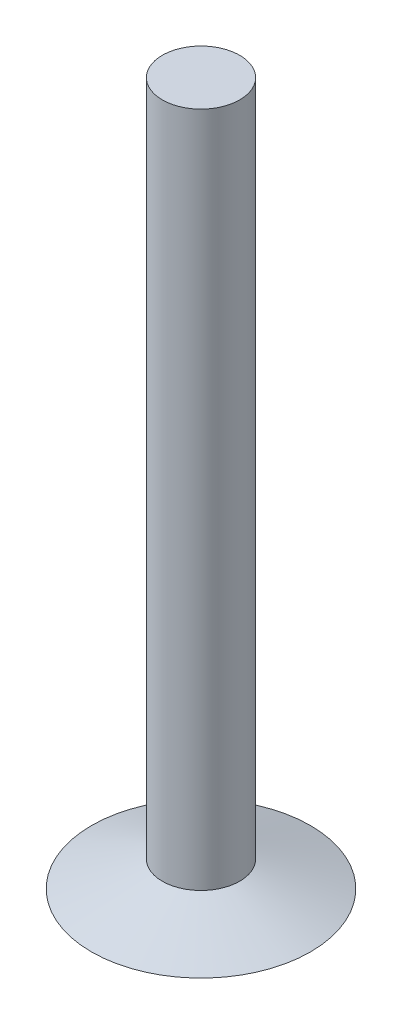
from build123d import *

# Parameters (mm, degrees)
SKETCH1_R                     = 60
BOSS_EXTRUDE1_DEPTH           = 1050
BOSS_EXTRUDE1_OTHER_WAY_DEPTH = 40
BOSS_EXTRUDE1_OTHER_WAY_TAPER = -70


with BuildPart() as part:
    # Sketch1 → Boss-Extrude1 (new body)
    with BuildSketch(Plane(origin=(0, 0, 0), x_dir=(1, 0, 0), z_dir=(0, 1, 0))):
        with Locations(Location((0, 0, 0), (0, 0, 270))):
            Circle(SKETCH1_R)
    extrude(amount=BOSS_EXTRUDE1_DEPTH)

    # Sketch1 → Boss-Extrude1 other way (add)
    with BuildSketch(Plane(origin=(0, 0, 0), x_dir=(1, 0, 0), z_dir=(0, 1, 0))):
        with Locations(Location((0, 0, 0), (0, 0, 270))):
            Circle(SKETCH1_R)
    extrude(amount=-BOSS_EXTRUDE1_OTHER_WAY_DEPTH, taper=BOSS_EXTRUDE1_OTHER_WAY_TAPER)


solid = part.part
